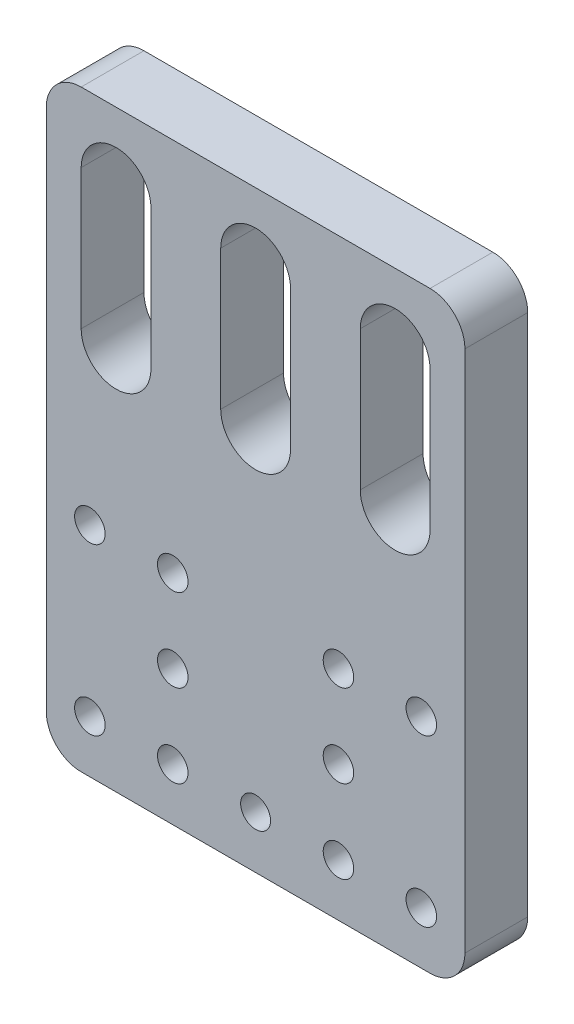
ISO-10303-21;
HEADER;
FILE_DESCRIPTION(('STEP AP214'),'2;1');
FILE_NAME('part.step','',(''),(''),'','','');
FILE_SCHEMA(('AUTOMOTIVE_DESIGN { 1 0 10303 214 1 1 1 1 }'));
ENDSEC;
DATA;
#1=APPLICATION_CONTEXT('core data for automotive mechanical design processes');
#2=APPLICATION_PROTOCOL_DEFINITION('international standard','automotive_design',2000,#1);
#3=PRODUCT_CONTEXT('',#1,'mechanical');
#4=PRODUCT('Part','Part','',(#3));
#5=PRODUCT_RELATED_PRODUCT_CATEGORY('part','',(#4));
#6=PRODUCT_DEFINITION_FORMATION('','',#4);
#7=PRODUCT_DEFINITION_CONTEXT('part definition',#1,'design');
#8=PRODUCT_DEFINITION('design','',#6,#7);
#9=PRODUCT_DEFINITION_SHAPE('','',#8);
#10=(LENGTH_UNIT() NAMED_UNIT(*) SI_UNIT(.MILLI.,.METRE.));
#11=(NAMED_UNIT(*) PLANE_ANGLE_UNIT() SI_UNIT($,.RADIAN.));
#12=(NAMED_UNIT(*) SI_UNIT($,.STERADIAN.) SOLID_ANGLE_UNIT());
#13=UNCERTAINTY_MEASURE_WITH_UNIT(LENGTH_MEASURE(1.E-05),#10,'distance_accuracy_value','');
#14=(GEOMETRIC_REPRESENTATION_CONTEXT(3) GLOBAL_UNCERTAINTY_ASSIGNED_CONTEXT((#13)) GLOBAL_UNIT_ASSIGNED_CONTEXT((#10,
#11,#12)) REPRESENTATION_CONTEXT('',''));
#15=CARTESIAN_POINT('',(0.,0.,0.));
#16=DIRECTION('',(0.,0.,1.));
#17=DIRECTION('',(1.,0.,0.));
#18=AXIS2_PLACEMENT_3D('',#15,#16,#17);
#19=CARTESIAN_POINT('',(0.,0.,3.6));
#20=DIRECTION('',(0.,0.,-1.));
#21=DIRECTION('',(-1.,0.,0.));
#22=AXIS2_PLACEMENT_3D('',#19,#20,#21);
#23=PLANE('',#22);
#24=CARTESIAN_POINT('',(4.75,-9.25000000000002,3.6));
#25=DIRECTION('',(0.,0.,-1.));
#26=DIRECTION('',(-1.,0.,0.));
#27=AXIS2_PLACEMENT_3D('',#24,#25,#26);
#28=CIRCLE('',#27,0.875);
#29=CARTESIAN_POINT('',(3.875,-9.25000000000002,3.6));
#30=VERTEX_POINT('',#29);
#31=EDGE_CURVE('E283',#30,#30,#28,.T.);
#32=ORIENTED_EDGE('',*,*,#31,.T.);
#33=EDGE_LOOP('',(#32));
#34=FACE_BOUND('',#33,.T.);
#35=CARTESIAN_POINT('',(-4.75,-9.25000000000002,3.6));
#36=DIRECTION('',(0.,0.,-1.));
#37=DIRECTION('',(-1.,0.,0.));
#38=AXIS2_PLACEMENT_3D('',#35,#36,#37);
#39=CIRCLE('',#38,0.875);
#40=CARTESIAN_POINT('',(-5.625,-9.25000000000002,3.6));
#41=VERTEX_POINT('',#40);
#42=EDGE_CURVE('E286',#41,#41,#39,.T.);
#43=ORIENTED_EDGE('',*,*,#42,.T.);
#44=EDGE_LOOP('',(#43));
#45=FACE_BOUND('',#44,.T.);
#46=CARTESIAN_POINT('',(0.,-14.,3.6));
#47=DIRECTION('',(0.,0.,1.));
#48=DIRECTION('',(1.,0.,0.));
#49=AXIS2_PLACEMENT_3D('',#46,#47,#48);
#50=CIRCLE('',#49,0.857839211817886);
#51=CARTESIAN_POINT('',(0.857839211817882,-14.,3.6));
#52=VERTEX_POINT('',#51);
#53=EDGE_CURVE('E289',#52,#52,#50,.F.);
#54=ORIENTED_EDGE('',*,*,#53,.T.);
#55=EDGE_LOOP('',(#54));
#56=FACE_BOUND('',#55,.T.);
#57=CARTESIAN_POINT('',(-4.75,-4.50000000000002,3.6));
#58=DIRECTION('',(0.,0.,-1.));
#59=DIRECTION('',(-1.,0.,0.));
#60=AXIS2_PLACEMENT_3D('',#57,#58,#59);
#61=CIRCLE('',#60,0.875);
#62=CARTESIAN_POINT('',(-5.625,-4.50000000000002,3.6));
#63=VERTEX_POINT('',#62);
#64=EDGE_CURVE('E292',#63,#63,#61,.T.);
#65=ORIENTED_EDGE('',*,*,#64,.T.);
#66=EDGE_LOOP('',(#65));
#67=FACE_BOUND('',#66,.T.);
#68=CARTESIAN_POINT('',(4.75,-4.50000000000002,3.6));
#69=DIRECTION('',(0.,0.,-1.));
#70=DIRECTION('',(-1.,0.,0.));
#71=AXIS2_PLACEMENT_3D('',#68,#69,#70);
#72=CIRCLE('',#71,0.875);
#73=CARTESIAN_POINT('',(3.875,-4.50000000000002,3.6));
#74=VERTEX_POINT('',#73);
#75=EDGE_CURVE('E295',#74,#74,#72,.T.);
#76=ORIENTED_EDGE('',*,*,#75,.T.);
#77=EDGE_LOOP('',(#76));
#78=FACE_BOUND('',#77,.T.);
#79=CARTESIAN_POINT('',(9.5,-14.,3.6));
#80=DIRECTION('',(0.,0.,-1.));
#81=DIRECTION('',(-1.,0.,0.));
#82=AXIS2_PLACEMENT_3D('',#79,#80,#81);
#83=CIRCLE('',#82,0.875000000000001);
#84=CARTESIAN_POINT('',(8.625,-14.,3.6));
#85=VERTEX_POINT('',#84);
#86=EDGE_CURVE('E201',#85,#85,#83,.T.);
#87=ORIENTED_EDGE('',*,*,#86,.T.);
#88=EDGE_LOOP('',(#87));
#89=FACE_BOUND('',#88,.T.);
#90=CARTESIAN_POINT('',(-9.5,-4.50000000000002,3.6));
#91=DIRECTION('',(0.,0.,-1.));
#92=DIRECTION('',(-1.,0.,0.));
#93=AXIS2_PLACEMENT_3D('',#90,#91,#92);
#94=CIRCLE('',#93,0.875000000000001);
#95=CARTESIAN_POINT('',(-10.375,-4.50000000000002,3.6));
#96=VERTEX_POINT('',#95);
#97=EDGE_CURVE('E312',#96,#96,#94,.T.);
#98=ORIENTED_EDGE('',*,*,#97,.T.);
#99=EDGE_LOOP('',(#98));
#100=FACE_BOUND('',#99,.T.);
#101=CARTESIAN_POINT('',(-9.5,-14.,3.6));
#102=DIRECTION('',(0.,0.,-1.));
#103=DIRECTION('',(-1.,0.,0.));
#104=AXIS2_PLACEMENT_3D('',#101,#102,#103);
#105=CIRCLE('',#104,0.875000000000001);
#106=CARTESIAN_POINT('',(-10.375,-14.,3.6));
#107=VERTEX_POINT('',#106);
#108=EDGE_CURVE('E315',#107,#107,#105,.T.);
#109=ORIENTED_EDGE('',*,*,#108,.T.);
#110=EDGE_LOOP('',(#109));
#111=FACE_BOUND('',#110,.T.);
#112=DIRECTION('',(0.,1.,0.));
#113=VECTOR('',#112,1.);
#114=CARTESIAN_POINT('',(-6.,13.,3.6));
#115=LINE('',#114,#113);
#116=CARTESIAN_POINT('',(-5.99999999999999,13.,3.6));
#117=VERTEX_POINT('',#116);
#118=CARTESIAN_POINT('',(-6.,4.99999999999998,3.6));
#119=VERTEX_POINT('',#118);
#120=EDGE_CURVE('E182',#117,#119,#115,.F.);
#121=ORIENTED_EDGE('',*,*,#120,.T.);
#122=CARTESIAN_POINT('',(-8.,4.99999999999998,3.6));
#123=DIRECTION('',(0.,0.,-1.));
#124=DIRECTION('',(-1.,0.,0.));
#125=AXIS2_PLACEMENT_3D('',#122,#123,#124);
#126=CIRCLE('',#125,2.);
#127=CARTESIAN_POINT('',(-10.,4.99999999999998,3.6));
#128=VERTEX_POINT('',#127);
#129=EDGE_CURVE('E299',#119,#128,#126,.T.);
#130=ORIENTED_EDGE('',*,*,#129,.T.);
#131=DIRECTION('',(0.,-1.,0.));
#132=VECTOR('',#131,1.);
#133=CARTESIAN_POINT('',(-10.,4.99999999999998,3.6));
#134=LINE('',#133,#132);
#135=CARTESIAN_POINT('',(-10.,13.,3.6));
#136=VERTEX_POINT('',#135);
#137=EDGE_CURVE('E186',#128,#136,#134,.F.);
#138=ORIENTED_EDGE('',*,*,#137,.T.);
#139=CARTESIAN_POINT('',(-7.99999999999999,13.,3.6));
#140=DIRECTION('',(0.,0.,-1.));
#141=DIRECTION('',(-1.,0.,0.));
#142=AXIS2_PLACEMENT_3D('',#139,#140,#141);
#143=CIRCLE('',#142,2.);
#144=EDGE_CURVE('E184',#136,#117,#143,.T.);
#145=ORIENTED_EDGE('',*,*,#144,.T.);
#146=EDGE_LOOP('',(#121,#130,#138,#145));
#147=FACE_BOUND('',#146,.T.);
#148=DIRECTION('',(0.,1.,0.));
#149=VECTOR('',#148,1.);
#150=CARTESIAN_POINT('',(2.,13.,3.6));
#151=LINE('',#150,#149);
#152=CARTESIAN_POINT('',(2.,13.,3.6));
#153=VERTEX_POINT('',#152);
#154=CARTESIAN_POINT('',(2.,4.99999999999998,3.6));
#155=VERTEX_POINT('',#154);
#156=EDGE_CURVE('E190',#153,#155,#151,.F.);
#157=ORIENTED_EDGE('',*,*,#156,.T.);
#158=CARTESIAN_POINT('',(0.,4.99999999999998,3.6));
#159=DIRECTION('',(0.,0.,-1.));
#160=DIRECTION('',(-1.,0.,0.));
#161=AXIS2_PLACEMENT_3D('',#158,#159,#160);
#162=CIRCLE('',#161,2.);
#163=CARTESIAN_POINT('',(-2.,4.99999999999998,3.6));
#164=VERTEX_POINT('',#163);
#165=EDGE_CURVE('E302',#155,#164,#162,.T.);
#166=ORIENTED_EDGE('',*,*,#165,.T.);
#167=DIRECTION('',(0.,-1.,0.));
#168=VECTOR('',#167,1.);
#169=CARTESIAN_POINT('',(-2.,4.99999999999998,3.6));
#170=LINE('',#169,#168);
#171=CARTESIAN_POINT('',(-2.,13.,3.6));
#172=VERTEX_POINT('',#171);
#173=EDGE_CURVE('E194',#164,#172,#170,.F.);
#174=ORIENTED_EDGE('',*,*,#173,.T.);
#175=CARTESIAN_POINT('',(0.,13.,3.6));
#176=DIRECTION('',(0.,0.,-1.));
#177=DIRECTION('',(-1.,0.,0.));
#178=AXIS2_PLACEMENT_3D('',#175,#176,#177);
#179=CIRCLE('',#178,2.);
#180=EDGE_CURVE('E192',#172,#153,#179,.T.);
#181=ORIENTED_EDGE('',*,*,#180,.T.);
#182=EDGE_LOOP('',(#157,#166,#174,#181));
#183=FACE_BOUND('',#182,.T.);
#184=CARTESIAN_POINT('',(10.,15.,3.6));
#185=DIRECTION('',(0.,0.,-1.));
#186=DIRECTION('',(-1.,0.,0.));
#187=AXIS2_PLACEMENT_3D('',#184,#185,#186);
#188=CIRCLE('',#187,2.);
#189=CARTESIAN_POINT('',(10.,17.,3.6));
#190=VERTEX_POINT('',#189);
#191=CARTESIAN_POINT('',(12.,15.,3.6));
#192=VERTEX_POINT('',#191);
#193=EDGE_CURVE('E151',#190,#192,#188,.T.);
#194=ORIENTED_EDGE('',*,*,#193,.F.);
#195=DIRECTION('',(1.,0.,0.));
#196=VECTOR('',#195,1.);
#197=CARTESIAN_POINT('',(12.,17.,3.6));
#198=LINE('',#197,#196);
#199=CARTESIAN_POINT('',(-10.,17.,3.6));
#200=VERTEX_POINT('',#199);
#201=EDGE_CURVE('E169',#190,#200,#198,.F.);
#202=ORIENTED_EDGE('',*,*,#201,.T.);
#203=CARTESIAN_POINT('',(-10.,15.,3.6));
#204=DIRECTION('',(0.,0.,-1.));
#205=DIRECTION('',(-1.,0.,0.));
#206=AXIS2_PLACEMENT_3D('',#203,#204,#205);
#207=CIRCLE('',#206,2.);
#208=CARTESIAN_POINT('',(-12.,15.,3.6));
#209=VERTEX_POINT('',#208);
#210=EDGE_CURVE('E209',#209,#200,#207,.T.);
#211=ORIENTED_EDGE('',*,*,#210,.F.);
#212=DIRECTION('',(0.,1.,0.));
#213=VECTOR('',#212,1.);
#214=CARTESIAN_POINT('',(-12.,17.,3.6));
#215=LINE('',#214,#213);
#216=CARTESIAN_POINT('',(-12.,-15.,3.6));
#217=VERTEX_POINT('',#216);
#218=EDGE_CURVE('E206',#209,#217,#215,.F.);
#219=ORIENTED_EDGE('',*,*,#218,.T.);
#220=CARTESIAN_POINT('',(-9.99999999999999,-15.,3.6));
#221=DIRECTION('',(0.,0.,-1.));
#222=DIRECTION('',(-1.,0.,0.));
#223=AXIS2_PLACEMENT_3D('',#220,#221,#222);
#224=CIRCLE('',#223,2.);
#225=CARTESIAN_POINT('',(-9.99999999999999,-17.,3.6));
#226=VERTEX_POINT('',#225);
#227=EDGE_CURVE('E322',#226,#217,#224,.T.);
#228=ORIENTED_EDGE('',*,*,#227,.F.);
#229=DIRECTION('',(-1.,0.,0.));
#230=VECTOR('',#229,1.);
#231=CARTESIAN_POINT('',(12.,-17.,3.6));
#232=LINE('',#231,#230);
#233=CARTESIAN_POINT('',(10.,-17.,3.6));
#234=VERTEX_POINT('',#233);
#235=EDGE_CURVE('E213',#226,#234,#232,.F.);
#236=ORIENTED_EDGE('',*,*,#235,.T.);
#237=CARTESIAN_POINT('',(10.,-15.,3.6));
#238=DIRECTION('',(0.,0.,-1.));
#239=DIRECTION('',(-1.,0.,0.));
#240=AXIS2_PLACEMENT_3D('',#237,#238,#239);
#241=CIRCLE('',#240,2.);
#242=CARTESIAN_POINT('',(12.,-15.,3.6));
#243=VERTEX_POINT('',#242);
#244=EDGE_CURVE('E157',#243,#234,#241,.T.);
#245=ORIENTED_EDGE('',*,*,#244,.F.);
#246=DIRECTION('',(0.,-1.,0.));
#247=VECTOR('',#246,1.);
#248=CARTESIAN_POINT('',(12.,17.,3.6));
#249=LINE('',#248,#247);
#250=EDGE_CURVE('E154',#243,#192,#249,.F.);
#251=ORIENTED_EDGE('',*,*,#250,.T.);
#252=EDGE_LOOP('',(#194,#202,#211,#219,#228,#236,#245,#251));
#253=FACE_BOUND('',#252,.T.);
#254=DIRECTION('',(0.,1.,0.));
#255=VECTOR('',#254,1.);
#256=CARTESIAN_POINT('',(10.,13.,3.6));
#257=LINE('',#256,#255);
#258=CARTESIAN_POINT('',(10.,13.,3.6));
#259=VERTEX_POINT('',#258);
#260=CARTESIAN_POINT('',(10.,4.99999999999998,3.6));
#261=VERTEX_POINT('',#260);
#262=EDGE_CURVE('E198',#259,#261,#257,.F.);
#263=ORIENTED_EDGE('',*,*,#262,.T.);
#264=CARTESIAN_POINT('',(8.,4.99999999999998,3.6));
#265=DIRECTION('',(0.,0.,-1.));
#266=DIRECTION('',(-1.,0.,0.));
#267=AXIS2_PLACEMENT_3D('',#264,#265,#266);
#268=CIRCLE('',#267,2.);
#269=CARTESIAN_POINT('',(6.,4.99999999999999,3.6));
#270=VERTEX_POINT('',#269);
#271=EDGE_CURVE('E306',#261,#270,#268,.T.);
#272=ORIENTED_EDGE('',*,*,#271,.T.);
#273=DIRECTION('',(0.,-1.,0.));
#274=VECTOR('',#273,1.);
#275=CARTESIAN_POINT('',(6.,4.99999999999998,3.6));
#276=LINE('',#275,#274);
#277=CARTESIAN_POINT('',(6.,13.,3.6));
#278=VERTEX_POINT('',#277);
#279=EDGE_CURVE('E202',#270,#278,#276,.F.);
#280=ORIENTED_EDGE('',*,*,#279,.T.);
#281=CARTESIAN_POINT('',(8.,13.,3.6));
#282=DIRECTION('',(0.,0.,-1.));
#283=DIRECTION('',(-1.,0.,0.));
#284=AXIS2_PLACEMENT_3D('',#281,#282,#283);
#285=CIRCLE('',#284,2.);
#286=EDGE_CURVE('E200',#278,#259,#285,.T.);
#287=ORIENTED_EDGE('',*,*,#286,.T.);
#288=EDGE_LOOP('',(#263,#272,#280,#287));
#289=FACE_BOUND('',#288,.T.);
#290=CARTESIAN_POINT('',(-4.75,-14.,3.6));
#291=DIRECTION('',(0.,0.,-1.));
#292=DIRECTION('',(-1.,0.,0.));
#293=AXIS2_PLACEMENT_3D('',#290,#291,#292);
#294=CIRCLE('',#293,0.875);
#295=CARTESIAN_POINT('',(-5.625,-14.,3.6));
#296=VERTEX_POINT('',#295);
#297=EDGE_CURVE('E212',#296,#296,#294,.T.);
#298=ORIENTED_EDGE('',*,*,#297,.T.);
#299=EDGE_LOOP('',(#298));
#300=FACE_BOUND('',#299,.T.);
#301=CARTESIAN_POINT('',(4.75,-14.,3.6));
#302=DIRECTION('',(0.,0.,-1.));
#303=DIRECTION('',(-1.,0.,0.));
#304=AXIS2_PLACEMENT_3D('',#301,#302,#303);
#305=CIRCLE('',#304,0.875);
#306=CARTESIAN_POINT('',(3.875,-14.,3.6));
#307=VERTEX_POINT('',#306);
#308=EDGE_CURVE('E326',#307,#307,#305,.T.);
#309=ORIENTED_EDGE('',*,*,#308,.T.);
#310=EDGE_LOOP('',(#309));
#311=FACE_BOUND('',#310,.T.);
#312=CARTESIAN_POINT('',(9.5,-4.50000000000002,3.6));
#313=DIRECTION('',(0.,0.,-1.));
#314=DIRECTION('',(-1.,0.,0.));
#315=AXIS2_PLACEMENT_3D('',#312,#313,#314);
#316=CIRCLE('',#315,0.875000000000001);
#317=CARTESIAN_POINT('',(8.625,-4.50000000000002,3.6));
#318=VERTEX_POINT('',#317);
#319=EDGE_CURVE('E19',#318,#318,#316,.T.);
#320=ORIENTED_EDGE('',*,*,#319,.T.);
#321=EDGE_LOOP('',(#320));
#322=FACE_BOUND('',#321,.T.);
#323=ADVANCED_FACE('F16',(#34,#45,#56,#67,#78,#89,#100,#111,#147,#183,#253,#289,#300,#311,#322),
#23,.F.);
#324=CARTESIAN_POINT('',(9.5,-4.50000000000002,3.6));
#325=DIRECTION('',(0.,0.,-1.));
#326=DIRECTION('',(-1.,0.,0.));
#327=AXIS2_PLACEMENT_3D('',#324,#325,#326);
#328=CYLINDRICAL_SURFACE('',#327,0.875000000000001);
#329=ORIENTED_EDGE('',*,*,#319,.F.);
#330=EDGE_LOOP('',(#329));
#331=FACE_BOUND('',#330,.T.);
#332=CARTESIAN_POINT('',(9.5,-4.50000000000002,0.));
#333=DIRECTION('',(0.,0.,-1.));
#334=DIRECTION('',(-1.,0.,0.));
#335=AXIS2_PLACEMENT_3D('',#332,#333,#334);
#336=CIRCLE('',#335,0.875000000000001);
#337=CARTESIAN_POINT('',(8.625,-4.50000000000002,0.));
#338=VERTEX_POINT('',#337);
#339=EDGE_CURVE('E280',#338,#338,#336,.F.);
#340=ORIENTED_EDGE('',*,*,#339,.F.);
#341=EDGE_LOOP('',(#340));
#342=FACE_BOUND('',#341,.T.);
#343=ADVANCED_FACE('F334',(#331,#342),#328,.F.);
#344=CARTESIAN_POINT('',(4.75,-14.,3.6));
#345=DIRECTION('',(0.,0.,-1.));
#346=DIRECTION('',(-1.,0.,0.));
#347=AXIS2_PLACEMENT_3D('',#344,#345,#346);
#348=CYLINDRICAL_SURFACE('',#347,0.875);
#349=ORIENTED_EDGE('',*,*,#308,.F.);
#350=EDGE_LOOP('',(#349));
#351=FACE_BOUND('',#350,.T.);
#352=CARTESIAN_POINT('',(4.75,-14.,0.));
#353=DIRECTION('',(0.,0.,-1.));
#354=DIRECTION('',(-1.,0.,0.));
#355=AXIS2_PLACEMENT_3D('',#352,#353,#354);
#356=CIRCLE('',#355,0.875);
#357=CARTESIAN_POINT('',(3.875,-14.,0.));
#358=VERTEX_POINT('',#357);
#359=EDGE_CURVE('E277',#358,#358,#356,.F.);
#360=ORIENTED_EDGE('',*,*,#359,.F.);
#361=EDGE_LOOP('',(#360));
#362=FACE_BOUND('',#361,.T.);
#363=ADVANCED_FACE('F337',(#351,#362),#348,.F.);
#364=CARTESIAN_POINT('',(-4.75,-14.,3.6));
#365=DIRECTION('',(0.,0.,-1.));
#366=DIRECTION('',(-1.,0.,0.));
#367=AXIS2_PLACEMENT_3D('',#364,#365,#366);
#368=CYLINDRICAL_SURFACE('',#367,0.875);
#369=CARTESIAN_POINT('',(-4.75,-14.,0.));
#370=DIRECTION('',(0.,0.,-1.));
#371=DIRECTION('',(-1.,0.,0.));
#372=AXIS2_PLACEMENT_3D('',#369,#370,#371);
#373=CIRCLE('',#372,0.875);
#374=CARTESIAN_POINT('',(-5.625,-14.,0.));
#375=VERTEX_POINT('',#374);
#376=EDGE_CURVE('E274',#375,#375,#373,.F.);
#377=ORIENTED_EDGE('',*,*,#376,.F.);
#378=EDGE_LOOP('',(#377));
#379=FACE_BOUND('',#378,.T.);
#380=ORIENTED_EDGE('',*,*,#297,.F.);
#381=EDGE_LOOP('',(#380));
#382=FACE_BOUND('',#381,.T.);
#383=ADVANCED_FACE('F455',(#379,#382),#368,.F.);
#384=CARTESIAN_POINT('',(12.,17.,3.6));
#385=DIRECTION('',(0.,-1.,0.));
#386=DIRECTION('',(1.,0.,0.));
#387=AXIS2_PLACEMENT_3D('',#384,#385,#386);
#388=PLANE('',#387);
#389=DIRECTION('',(0.,0.,-1.));
#390=VECTOR('',#389,1.);
#391=CARTESIAN_POINT('',(10.,17.,3.6));
#392=LINE('',#391,#390);
#393=CARTESIAN_POINT('',(10.,17.,0.));
#394=VERTEX_POINT('',#393);
#395=EDGE_CURVE('E162',#394,#190,#392,.F.);
#396=ORIENTED_EDGE('',*,*,#395,.F.);
#397=DIRECTION('',(-1.,0.,0.));
#398=VECTOR('',#397,1.);
#399=CARTESIAN_POINT('',(0.,17.,0.));
#400=LINE('',#399,#398);
#401=CARTESIAN_POINT('',(-10.,17.,0.));
#402=VERTEX_POINT('',#401);
#403=EDGE_CURVE('E273',#402,#394,#400,.F.);
#404=ORIENTED_EDGE('',*,*,#403,.F.);
#405=DIRECTION('',(0.,0.,-1.));
#406=VECTOR('',#405,1.);
#407=CARTESIAN_POINT('',(-10.,17.,3.6));
#408=LINE('',#407,#406);
#409=EDGE_CURVE('E321',#200,#402,#408,.T.);
#410=ORIENTED_EDGE('',*,*,#409,.F.);
#411=ORIENTED_EDGE('',*,*,#201,.F.);
#412=EDGE_LOOP('',(#396,#404,#410,#411));
#413=FACE_BOUND('',#412,.T.);
#414=ADVANCED_FACE('F452',(#413),#388,.F.);
#415=CARTESIAN_POINT('',(10.,15.,3.6));
#416=DIRECTION('',(0.,0.,-1.));
#417=DIRECTION('',(-1.,0.,0.));
#418=AXIS2_PLACEMENT_3D('',#415,#416,#417);
#419=CYLINDRICAL_SURFACE('',#418,2.);
#420=CARTESIAN_POINT('',(10.,15.,0.));
#421=DIRECTION('',(0.,0.,-1.));
#422=DIRECTION('',(-1.,0.,0.));
#423=AXIS2_PLACEMENT_3D('',#420,#421,#422);
#424=CIRCLE('',#423,2.);
#425=CARTESIAN_POINT('',(12.,15.,0.));
#426=VERTEX_POINT('',#425);
#427=EDGE_CURVE('E271',#394,#426,#424,.T.);
#428=ORIENTED_EDGE('',*,*,#427,.F.);
#429=ORIENTED_EDGE('',*,*,#395,.T.);
#430=ORIENTED_EDGE('',*,*,#193,.T.);
#431=DIRECTION('',(0.,0.,1.));
#432=VECTOR('',#431,1.);
#433=CARTESIAN_POINT('',(12.,15.,3.6));
#434=LINE('',#433,#432);
#435=EDGE_CURVE('E161',#192,#426,#434,.F.);
#436=ORIENTED_EDGE('',*,*,#435,.T.);
#437=EDGE_LOOP('',(#428,#429,#430,#436));
#438=FACE_BOUND('',#437,.T.);
#439=ADVANCED_FACE('F167',(#438),#419,.T.);
#440=CARTESIAN_POINT('',(12.,17.,3.6));
#441=DIRECTION('',(-1.,0.,0.));
#442=DIRECTION('',(0.,-1.,0.));
#443=AXIS2_PLACEMENT_3D('',#440,#441,#442);
#444=PLANE('',#443);
#445=ORIENTED_EDGE('',*,*,#435,.F.);
#446=ORIENTED_EDGE('',*,*,#250,.F.);
#447=DIRECTION('',(0.,0.,-1.));
#448=VECTOR('',#447,1.);
#449=CARTESIAN_POINT('',(12.,-15.,3.6));
#450=LINE('',#449,#448);
#451=CARTESIAN_POINT('',(12.,-15.,0.));
#452=VERTEX_POINT('',#451);
#453=EDGE_CURVE('E176',#452,#243,#450,.F.);
#454=ORIENTED_EDGE('',*,*,#453,.F.);
#455=DIRECTION('',(0.,1.,0.));
#456=VECTOR('',#455,1.);
#457=CARTESIAN_POINT('',(12.,0.,0.));
#458=LINE('',#457,#456);
#459=EDGE_CURVE('E173',#426,#452,#458,.F.);
#460=ORIENTED_EDGE('',*,*,#459,.F.);
#461=EDGE_LOOP('',(#445,#446,#454,#460));
#462=FACE_BOUND('',#461,.T.);
#463=ADVANCED_FACE('F171',(#462),#444,.F.);
#464=CARTESIAN_POINT('',(10.,-15.,3.6));
#465=DIRECTION('',(0.,0.,-1.));
#466=DIRECTION('',(-1.,0.,0.));
#467=AXIS2_PLACEMENT_3D('',#464,#465,#466);
#468=CYLINDRICAL_SURFACE('',#467,2.);
#469=CARTESIAN_POINT('',(10.,-15.,0.));
#470=DIRECTION('',(0.,0.,-1.));
#471=DIRECTION('',(-1.,0.,0.));
#472=AXIS2_PLACEMENT_3D('',#469,#470,#471);
#473=CIRCLE('',#472,2.);
#474=CARTESIAN_POINT('',(10.,-17.,0.));
#475=VERTEX_POINT('',#474);
#476=EDGE_CURVE('E268',#452,#475,#473,.T.);
#477=ORIENTED_EDGE('',*,*,#476,.F.);
#478=ORIENTED_EDGE('',*,*,#453,.T.);
#479=ORIENTED_EDGE('',*,*,#244,.T.);
#480=DIRECTION('',(0.,0.,1.));
#481=VECTOR('',#480,1.);
#482=CARTESIAN_POINT('',(10.,-17.,3.6));
#483=LINE('',#482,#481);
#484=EDGE_CURVE('E214',#234,#475,#483,.F.);
#485=ORIENTED_EDGE('',*,*,#484,.T.);
#486=EDGE_LOOP('',(#477,#478,#479,#485));
#487=FACE_BOUND('',#486,.T.);
#488=ADVANCED_FACE('F443',(#487),#468,.T.);
#489=CARTESIAN_POINT('',(12.,-17.,3.6));
#490=DIRECTION('',(0.,1.,0.));
#491=DIRECTION('',(-1.,0.,0.));
#492=AXIS2_PLACEMENT_3D('',#489,#490,#491);
#493=PLANE('',#492);
#494=ORIENTED_EDGE('',*,*,#484,.F.);
#495=ORIENTED_EDGE('',*,*,#235,.F.);
#496=DIRECTION('',(0.,0.,-1.));
#497=VECTOR('',#496,1.);
#498=CARTESIAN_POINT('',(-9.99999999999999,-17.,3.6));
#499=LINE('',#498,#497);
#500=CARTESIAN_POINT('',(-9.99999999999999,-17.,0.));
#501=VERTEX_POINT('',#500);
#502=EDGE_CURVE('E323',#501,#226,#499,.F.);
#503=ORIENTED_EDGE('',*,*,#502,.F.);
#504=DIRECTION('',(-1.,0.,0.));
#505=VECTOR('',#504,1.);
#506=CARTESIAN_POINT('',(0.,-17.,0.));
#507=LINE('',#506,#505);
#508=EDGE_CURVE('E267',#475,#501,#507,.T.);
#509=ORIENTED_EDGE('',*,*,#508,.F.);
#510=EDGE_LOOP('',(#494,#495,#503,#509));
#511=FACE_BOUND('',#510,.T.);
#512=ADVANCED_FACE('F439',(#511),#493,.F.);
#513=CARTESIAN_POINT('',(-9.99999999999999,-15.,3.6));
#514=DIRECTION('',(0.,0.,-1.));
#515=DIRECTION('',(-1.,0.,0.));
#516=AXIS2_PLACEMENT_3D('',#513,#514,#515);
#517=CYLINDRICAL_SURFACE('',#516,2.);
#518=CARTESIAN_POINT('',(-9.99999999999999,-15.,0.));
#519=DIRECTION('',(0.,0.,-1.));
#520=DIRECTION('',(-1.,0.,0.));
#521=AXIS2_PLACEMENT_3D('',#518,#519,#520);
#522=CIRCLE('',#521,2.);
#523=CARTESIAN_POINT('',(-12.,-15.,0.));
#524=VERTEX_POINT('',#523);
#525=EDGE_CURVE('E264',#501,#524,#522,.T.);
#526=ORIENTED_EDGE('',*,*,#525,.F.);
#527=ORIENTED_EDGE('',*,*,#502,.T.);
#528=ORIENTED_EDGE('',*,*,#227,.T.);
#529=DIRECTION('',(0.,0.,1.));
#530=VECTOR('',#529,1.);
#531=CARTESIAN_POINT('',(-12.,-15.,3.6));
#532=LINE('',#531,#530);
#533=EDGE_CURVE('E210',#217,#524,#532,.F.);
#534=ORIENTED_EDGE('',*,*,#533,.T.);
#535=EDGE_LOOP('',(#526,#527,#528,#534));
#536=FACE_BOUND('',#535,.T.);
#537=ADVANCED_FACE('F435',(#536),#517,.T.);
#538=CARTESIAN_POINT('',(-12.,17.,3.6));
#539=DIRECTION('',(1.,0.,0.));
#540=DIRECTION('',(0.,1.,0.));
#541=AXIS2_PLACEMENT_3D('',#538,#539,#540);
#542=PLANE('',#541);
#543=DIRECTION('',(0.,0.,-1.));
#544=VECTOR('',#543,1.);
#545=CARTESIAN_POINT('',(-12.,15.,3.6));
#546=LINE('',#545,#544);
#547=CARTESIAN_POINT('',(-12.,15.,0.));
#548=VERTEX_POINT('',#547);
#549=EDGE_CURVE('E318',#548,#209,#546,.F.);
#550=ORIENTED_EDGE('',*,*,#549,.F.);
#551=DIRECTION('',(0.,1.,0.));
#552=VECTOR('',#551,1.);
#553=CARTESIAN_POINT('',(-12.,0.,0.));
#554=LINE('',#553,#552);
#555=EDGE_CURVE('E263',#524,#548,#554,.T.);
#556=ORIENTED_EDGE('',*,*,#555,.F.);
#557=ORIENTED_EDGE('',*,*,#533,.F.);
#558=ORIENTED_EDGE('',*,*,#218,.F.);
#559=EDGE_LOOP('',(#550,#556,#557,#558));
#560=FACE_BOUND('',#559,.T.);
#561=ADVANCED_FACE('F431',(#560),#542,.F.);
#562=CARTESIAN_POINT('',(-10.,15.,3.6));
#563=DIRECTION('',(0.,0.,-1.));
#564=DIRECTION('',(-1.,0.,0.));
#565=AXIS2_PLACEMENT_3D('',#562,#563,#564);
#566=CYLINDRICAL_SURFACE('',#565,2.);
#567=CARTESIAN_POINT('',(-10.,15.,0.));
#568=DIRECTION('',(0.,0.,-1.));
#569=DIRECTION('',(-1.,0.,0.));
#570=AXIS2_PLACEMENT_3D('',#567,#568,#569);
#571=CIRCLE('',#570,2.);
#572=EDGE_CURVE('E260',#548,#402,#571,.T.);
#573=ORIENTED_EDGE('',*,*,#572,.F.);
#574=ORIENTED_EDGE('',*,*,#549,.T.);
#575=ORIENTED_EDGE('',*,*,#210,.T.);
#576=ORIENTED_EDGE('',*,*,#409,.T.);
#577=EDGE_LOOP('',(#573,#574,#575,#576));
#578=FACE_BOUND('',#577,.T.);
#579=ADVANCED_FACE('F427',(#578),#566,.T.);
#580=CARTESIAN_POINT('',(-9.5,-14.,3.6));
#581=DIRECTION('',(0.,0.,-1.));
#582=DIRECTION('',(-1.,0.,0.));
#583=AXIS2_PLACEMENT_3D('',#580,#581,#582);
#584=CYLINDRICAL_SURFACE('',#583,0.875000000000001);
#585=CARTESIAN_POINT('',(-9.5,-14.,0.));
#586=DIRECTION('',(0.,0.,-1.));
#587=DIRECTION('',(-1.,0.,0.));
#588=AXIS2_PLACEMENT_3D('',#585,#586,#587);
#589=CIRCLE('',#588,0.875000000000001);
#590=CARTESIAN_POINT('',(-10.375,-14.,0.));
#591=VERTEX_POINT('',#590);
#592=EDGE_CURVE('E257',#591,#591,#589,.F.);
#593=ORIENTED_EDGE('',*,*,#592,.F.);
#594=EDGE_LOOP('',(#593));
#595=FACE_BOUND('',#594,.T.);
#596=ORIENTED_EDGE('',*,*,#108,.F.);
#597=EDGE_LOOP('',(#596));
#598=FACE_BOUND('',#597,.T.);
#599=ADVANCED_FACE('F423',(#595,#598),#584,.F.);
#600=CARTESIAN_POINT('',(-9.5,-4.50000000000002,3.6));
#601=DIRECTION('',(0.,0.,-1.));
#602=DIRECTION('',(-1.,0.,0.));
#603=AXIS2_PLACEMENT_3D('',#600,#601,#602);
#604=CYLINDRICAL_SURFACE('',#603,0.875000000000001);
#605=CARTESIAN_POINT('',(-9.5,-4.50000000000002,0.));
#606=DIRECTION('',(0.,0.,-1.));
#607=DIRECTION('',(-1.,0.,0.));
#608=AXIS2_PLACEMENT_3D('',#605,#606,#607);
#609=CIRCLE('',#608,0.875000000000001);
#610=CARTESIAN_POINT('',(-10.375,-4.50000000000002,0.));
#611=VERTEX_POINT('',#610);
#612=EDGE_CURVE('E254',#611,#611,#609,.F.);
#613=ORIENTED_EDGE('',*,*,#612,.F.);
#614=EDGE_LOOP('',(#613));
#615=FACE_BOUND('',#614,.T.);
#616=ORIENTED_EDGE('',*,*,#97,.F.);
#617=EDGE_LOOP('',(#616));
#618=FACE_BOUND('',#617,.T.);
#619=ADVANCED_FACE('F419',(#615,#618),#604,.F.);
#620=CARTESIAN_POINT('',(9.5,-14.,3.6));
#621=DIRECTION('',(0.,0.,-1.));
#622=DIRECTION('',(-1.,0.,0.));
#623=AXIS2_PLACEMENT_3D('',#620,#621,#622);
#624=CYLINDRICAL_SURFACE('',#623,0.875000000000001);
#625=ORIENTED_EDGE('',*,*,#86,.F.);
#626=EDGE_LOOP('',(#625));
#627=FACE_BOUND('',#626,.T.);
#628=CARTESIAN_POINT('',(9.5,-14.,0.));
#629=DIRECTION('',(0.,0.,-1.));
#630=DIRECTION('',(-1.,0.,0.));
#631=AXIS2_PLACEMENT_3D('',#628,#629,#630);
#632=CIRCLE('',#631,0.875000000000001);
#633=CARTESIAN_POINT('',(8.625,-14.,0.));
#634=VERTEX_POINT('',#633);
#635=EDGE_CURVE('E251',#634,#634,#632,.F.);
#636=ORIENTED_EDGE('',*,*,#635,.F.);
#637=EDGE_LOOP('',(#636));
#638=FACE_BOUND('',#637,.T.);
#639=ADVANCED_FACE('F415',(#627,#638),#624,.F.);
#640=CARTESIAN_POINT('',(10.,13.,3.6));
#641=DIRECTION('',(1.,0.,0.));
#642=DIRECTION('',(0.,1.,0.));
#643=AXIS2_PLACEMENT_3D('',#640,#641,#642);
#644=PLANE('',#643);
#645=DIRECTION('',(0.,0.,-1.));
#646=VECTOR('',#645,1.);
#647=CARTESIAN_POINT('',(10.,4.99999999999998,3.6));
#648=LINE('',#647,#646);
#649=CARTESIAN_POINT('',(10.,4.99999999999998,0.));
#650=VERTEX_POINT('',#649);
#651=EDGE_CURVE('E193',#650,#261,#648,.F.);
#652=ORIENTED_EDGE('',*,*,#651,.T.);
#653=ORIENTED_EDGE('',*,*,#262,.F.);
#654=DIRECTION('',(0.,0.,-1.));
#655=VECTOR('',#654,1.);
#656=CARTESIAN_POINT('',(10.,13.,3.6));
#657=LINE('',#656,#655);
#658=CARTESIAN_POINT('',(10.,13.,0.));
#659=VERTEX_POINT('',#658);
#660=EDGE_CURVE('E205',#259,#659,#657,.T.);
#661=ORIENTED_EDGE('',*,*,#660,.T.);
#662=DIRECTION('',(0.,1.,0.));
#663=VECTOR('',#662,1.);
#664=CARTESIAN_POINT('',(10.,0.,0.));
#665=LINE('',#664,#663);
#666=EDGE_CURVE('E250',#650,#659,#665,.T.);
#667=ORIENTED_EDGE('',*,*,#666,.F.);
#668=EDGE_LOOP('',(#652,#653,#661,#667));
#669=FACE_BOUND('',#668,.T.);
#670=ADVANCED_FACE('F411',(#669),#644,.F.);
#671=CARTESIAN_POINT('',(8.,13.,3.6));
#672=DIRECTION('',(0.,0.,-1.));
#673=DIRECTION('',(-1.,0.,0.));
#674=AXIS2_PLACEMENT_3D('',#671,#672,#673);
#675=CYLINDRICAL_SURFACE('',#674,2.);
#676=ORIENTED_EDGE('',*,*,#660,.F.);
#677=ORIENTED_EDGE('',*,*,#286,.F.);
#678=DIRECTION('',(0.,0.,1.));
#679=VECTOR('',#678,1.);
#680=CARTESIAN_POINT('',(6.,13.,3.6));
#681=LINE('',#680,#679);
#682=CARTESIAN_POINT('',(6.,13.,0.));
#683=VERTEX_POINT('',#682);
#684=EDGE_CURVE('E204',#278,#683,#681,.F.);
#685=ORIENTED_EDGE('',*,*,#684,.T.);
#686=CARTESIAN_POINT('',(8.,13.,0.));
#687=DIRECTION('',(0.,0.,-1.));
#688=DIRECTION('',(-1.,0.,0.));
#689=AXIS2_PLACEMENT_3D('',#686,#687,#688);
#690=CIRCLE('',#689,2.);
#691=EDGE_CURVE('E247',#659,#683,#690,.F.);
#692=ORIENTED_EDGE('',*,*,#691,.F.);
#693=EDGE_LOOP('',(#676,#677,#685,#692));
#694=FACE_BOUND('',#693,.T.);
#695=ADVANCED_FACE('F407',(#694),#675,.F.);
#696=CARTESIAN_POINT('',(6.,4.99999999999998,3.6));
#697=DIRECTION('',(-1.,0.,0.));
#698=DIRECTION('',(0.,-1.,0.));
#699=AXIS2_PLACEMENT_3D('',#696,#697,#698);
#700=PLANE('',#699);
#701=ORIENTED_EDGE('',*,*,#684,.F.);
#702=ORIENTED_EDGE('',*,*,#279,.F.);
#703=DIRECTION('',(0.,0.,-1.));
#704=VECTOR('',#703,1.);
#705=CARTESIAN_POINT('',(6.,4.99999999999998,3.6));
#706=LINE('',#705,#704);
#707=CARTESIAN_POINT('',(6.,4.99999999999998,0.));
#708=VERTEX_POINT('',#707);
#709=EDGE_CURVE('E308',#270,#708,#706,.T.);
#710=ORIENTED_EDGE('',*,*,#709,.T.);
#711=DIRECTION('',(0.,1.,0.));
#712=VECTOR('',#711,1.);
#713=CARTESIAN_POINT('',(6.,0.,0.));
#714=LINE('',#713,#712);
#715=EDGE_CURVE('E246',#683,#708,#714,.F.);
#716=ORIENTED_EDGE('',*,*,#715,.F.);
#717=EDGE_LOOP('',(#701,#702,#710,#716));
#718=FACE_BOUND('',#717,.T.);
#719=ADVANCED_FACE('F403',(#718),#700,.F.);
#720=CARTESIAN_POINT('',(8.,4.99999999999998,3.6));
#721=DIRECTION('',(0.,0.,-1.));
#722=DIRECTION('',(-1.,0.,0.));
#723=AXIS2_PLACEMENT_3D('',#720,#721,#722);
#724=CYLINDRICAL_SURFACE('',#723,2.);
#725=CARTESIAN_POINT('',(8.,4.99999999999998,0.));
#726=DIRECTION('',(0.,0.,-1.));
#727=DIRECTION('',(-1.,0.,0.));
#728=AXIS2_PLACEMENT_3D('',#725,#726,#727);
#729=CIRCLE('',#728,2.);
#730=EDGE_CURVE('E243',#708,#650,#729,.F.);
#731=ORIENTED_EDGE('',*,*,#730,.F.);
#732=ORIENTED_EDGE('',*,*,#709,.F.);
#733=ORIENTED_EDGE('',*,*,#271,.F.);
#734=ORIENTED_EDGE('',*,*,#651,.F.);
#735=EDGE_LOOP('',(#731,#732,#733,#734));
#736=FACE_BOUND('',#735,.T.);
#737=ADVANCED_FACE('F399',(#736),#724,.F.);
#738=CARTESIAN_POINT('',(2.,13.,3.6));
#739=DIRECTION('',(1.,0.,0.));
#740=DIRECTION('',(0.,1.,0.));
#741=AXIS2_PLACEMENT_3D('',#738,#739,#740);
#742=PLANE('',#741);
#743=DIRECTION('',(0.,0.,-1.));
#744=VECTOR('',#743,1.);
#745=CARTESIAN_POINT('',(2.,4.99999999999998,3.6));
#746=LINE('',#745,#744);
#747=CARTESIAN_POINT('',(2.,4.99999999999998,0.));
#748=VERTEX_POINT('',#747);
#749=EDGE_CURVE('E185',#748,#155,#746,.F.);
#750=ORIENTED_EDGE('',*,*,#749,.T.);
#751=ORIENTED_EDGE('',*,*,#156,.F.);
#752=DIRECTION('',(0.,0.,-1.));
#753=VECTOR('',#752,1.);
#754=CARTESIAN_POINT('',(2.,13.,3.6));
#755=LINE('',#754,#753);
#756=CARTESIAN_POINT('',(2.,13.,0.));
#757=VERTEX_POINT('',#756);
#758=EDGE_CURVE('E197',#153,#757,#755,.T.);
#759=ORIENTED_EDGE('',*,*,#758,.T.);
#760=DIRECTION('',(0.,1.,0.));
#761=VECTOR('',#760,1.);
#762=CARTESIAN_POINT('',(2.,0.,0.));
#763=LINE('',#762,#761);
#764=EDGE_CURVE('E242',#748,#757,#763,.T.);
#765=ORIENTED_EDGE('',*,*,#764,.F.);
#766=EDGE_LOOP('',(#750,#751,#759,#765));
#767=FACE_BOUND('',#766,.T.);
#768=ADVANCED_FACE('F395',(#767),#742,.F.);
#769=CARTESIAN_POINT('',(0.,13.,3.6));
#770=DIRECTION('',(0.,0.,-1.));
#771=DIRECTION('',(-1.,0.,0.));
#772=AXIS2_PLACEMENT_3D('',#769,#770,#771);
#773=CYLINDRICAL_SURFACE('',#772,2.);
#774=ORIENTED_EDGE('',*,*,#758,.F.);
#775=ORIENTED_EDGE('',*,*,#180,.F.);
#776=DIRECTION('',(0.,0.,1.));
#777=VECTOR('',#776,1.);
#778=CARTESIAN_POINT('',(-2.,13.,3.6));
#779=LINE('',#778,#777);
#780=CARTESIAN_POINT('',(-2.,13.,0.));
#781=VERTEX_POINT('',#780);
#782=EDGE_CURVE('E196',#172,#781,#779,.F.);
#783=ORIENTED_EDGE('',*,*,#782,.T.);
#784=CARTESIAN_POINT('',(0.,13.,0.));
#785=DIRECTION('',(0.,0.,-1.));
#786=DIRECTION('',(-1.,0.,0.));
#787=AXIS2_PLACEMENT_3D('',#784,#785,#786);
#788=CIRCLE('',#787,2.);
#789=EDGE_CURVE('E239',#757,#781,#788,.F.);
#790=ORIENTED_EDGE('',*,*,#789,.F.);
#791=EDGE_LOOP('',(#774,#775,#783,#790));
#792=FACE_BOUND('',#791,.T.);
#793=ADVANCED_FACE('F391',(#792),#773,.F.);
#794=CARTESIAN_POINT('',(-2.,4.99999999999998,3.6));
#795=DIRECTION('',(-1.,0.,0.));
#796=DIRECTION('',(0.,-1.,0.));
#797=AXIS2_PLACEMENT_3D('',#794,#795,#796);
#798=PLANE('',#797);
#799=ORIENTED_EDGE('',*,*,#782,.F.);
#800=ORIENTED_EDGE('',*,*,#173,.F.);
#801=DIRECTION('',(0.,0.,-1.));
#802=VECTOR('',#801,1.);
#803=CARTESIAN_POINT('',(-2.,4.99999999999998,3.6));
#804=LINE('',#803,#802);
#805=CARTESIAN_POINT('',(-2.,4.99999999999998,0.));
#806=VERTEX_POINT('',#805);
#807=EDGE_CURVE('E304',#164,#806,#804,.T.);
#808=ORIENTED_EDGE('',*,*,#807,.T.);
#809=DIRECTION('',(0.,1.,0.));
#810=VECTOR('',#809,1.);
#811=CARTESIAN_POINT('',(-2.,0.,0.));
#812=LINE('',#811,#810);
#813=EDGE_CURVE('E238',#781,#806,#812,.F.);
#814=ORIENTED_EDGE('',*,*,#813,.F.);
#815=EDGE_LOOP('',(#799,#800,#808,#814));
#816=FACE_BOUND('',#815,.T.);
#817=ADVANCED_FACE('F387',(#816),#798,.F.);
#818=CARTESIAN_POINT('',(0.,4.99999999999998,3.6));
#819=DIRECTION('',(0.,0.,-1.));
#820=DIRECTION('',(-1.,0.,0.));
#821=AXIS2_PLACEMENT_3D('',#818,#819,#820);
#822=CYLINDRICAL_SURFACE('',#821,2.);
#823=CARTESIAN_POINT('',(0.,4.99999999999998,0.));
#824=DIRECTION('',(0.,0.,-1.));
#825=DIRECTION('',(-1.,0.,0.));
#826=AXIS2_PLACEMENT_3D('',#823,#824,#825);
#827=CIRCLE('',#826,2.);
#828=EDGE_CURVE('E235',#806,#748,#827,.F.);
#829=ORIENTED_EDGE('',*,*,#828,.F.);
#830=ORIENTED_EDGE('',*,*,#807,.F.);
#831=ORIENTED_EDGE('',*,*,#165,.F.);
#832=ORIENTED_EDGE('',*,*,#749,.F.);
#833=EDGE_LOOP('',(#829,#830,#831,#832));
#834=FACE_BOUND('',#833,.T.);
#835=ADVANCED_FACE('F383',(#834),#822,.F.);
#836=CARTESIAN_POINT('',(-6.,13.,3.6));
#837=DIRECTION('',(1.,0.,0.));
#838=DIRECTION('',(0.,1.,0.));
#839=AXIS2_PLACEMENT_3D('',#836,#837,#838);
#840=PLANE('',#839);
#841=DIRECTION('',(0.,0.,-1.));
#842=VECTOR('',#841,1.);
#843=CARTESIAN_POINT('',(-6.,4.99999999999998,3.6));
#844=LINE('',#843,#842);
#845=CARTESIAN_POINT('',(-6.,4.99999999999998,0.));
#846=VERTEX_POINT('',#845);
#847=EDGE_CURVE('E298',#846,#119,#844,.F.);
#848=ORIENTED_EDGE('',*,*,#847,.T.);
#849=ORIENTED_EDGE('',*,*,#120,.F.);
#850=DIRECTION('',(0.,0.,-1.));
#851=VECTOR('',#850,1.);
#852=CARTESIAN_POINT('',(-5.99999999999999,13.,3.6));
#853=LINE('',#852,#851);
#854=CARTESIAN_POINT('',(-5.99999999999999,13.,0.));
#855=VERTEX_POINT('',#854);
#856=EDGE_CURVE('E189',#117,#855,#853,.T.);
#857=ORIENTED_EDGE('',*,*,#856,.T.);
#858=DIRECTION('',(0.,1.,0.));
#859=VECTOR('',#858,1.);
#860=CARTESIAN_POINT('',(-6.,0.,0.));
#861=LINE('',#860,#859);
#862=EDGE_CURVE('E234',#846,#855,#861,.T.);
#863=ORIENTED_EDGE('',*,*,#862,.F.);
#864=EDGE_LOOP('',(#848,#849,#857,#863));
#865=FACE_BOUND('',#864,.T.);
#866=ADVANCED_FACE('F379',(#865),#840,.F.);
#867=CARTESIAN_POINT('',(-7.99999999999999,13.,3.6));
#868=DIRECTION('',(0.,0.,-1.));
#869=DIRECTION('',(-1.,0.,0.));
#870=AXIS2_PLACEMENT_3D('',#867,#868,#869);
#871=CYLINDRICAL_SURFACE('',#870,2.);
#872=ORIENTED_EDGE('',*,*,#856,.F.);
#873=ORIENTED_EDGE('',*,*,#144,.F.);
#874=DIRECTION('',(0.,0.,1.));
#875=VECTOR('',#874,1.);
#876=CARTESIAN_POINT('',(-10.,13.,3.6));
#877=LINE('',#876,#875);
#878=CARTESIAN_POINT('',(-10.,13.,0.));
#879=VERTEX_POINT('',#878);
#880=EDGE_CURVE('E188',#136,#879,#877,.F.);
#881=ORIENTED_EDGE('',*,*,#880,.T.);
#882=CARTESIAN_POINT('',(-7.99999999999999,13.,0.));
#883=DIRECTION('',(0.,0.,-1.));
#884=DIRECTION('',(-1.,0.,0.));
#885=AXIS2_PLACEMENT_3D('',#882,#883,#884);
#886=CIRCLE('',#885,2.);
#887=EDGE_CURVE('E231',#855,#879,#886,.F.);
#888=ORIENTED_EDGE('',*,*,#887,.F.);
#889=EDGE_LOOP('',(#872,#873,#881,#888));
#890=FACE_BOUND('',#889,.T.);
#891=ADVANCED_FACE('F376',(#890),#871,.F.);
#892=CARTESIAN_POINT('',(-10.,4.99999999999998,3.6));
#893=DIRECTION('',(-1.,0.,0.));
#894=DIRECTION('',(0.,-1.,0.));
#895=AXIS2_PLACEMENT_3D('',#892,#893,#894);
#896=PLANE('',#895);
#897=ORIENTED_EDGE('',*,*,#880,.F.);
#898=ORIENTED_EDGE('',*,*,#137,.F.);
#899=DIRECTION('',(0.,0.,-1.));
#900=VECTOR('',#899,1.);
#901=CARTESIAN_POINT('',(-10.,4.99999999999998,3.6));
#902=LINE('',#901,#900);
#903=CARTESIAN_POINT('',(-10.,4.99999999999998,0.));
#904=VERTEX_POINT('',#903);
#905=EDGE_CURVE('E34',#128,#904,#902,.T.);
#906=ORIENTED_EDGE('',*,*,#905,.T.);
#907=DIRECTION('',(0.,1.,0.));
#908=VECTOR('',#907,1.);
#909=CARTESIAN_POINT('',(-10.,0.,0.));
#910=LINE('',#909,#908);
#911=EDGE_CURVE('E230',#879,#904,#910,.F.);
#912=ORIENTED_EDGE('',*,*,#911,.F.);
#913=EDGE_LOOP('',(#897,#898,#906,#912));
#914=FACE_BOUND('',#913,.T.);
#915=ADVANCED_FACE('F372',(#914),#896,.F.);
#916=CARTESIAN_POINT('',(-8.,4.99999999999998,3.6));
#917=DIRECTION('',(0.,0.,-1.));
#918=DIRECTION('',(-1.,0.,0.));
#919=AXIS2_PLACEMENT_3D('',#916,#917,#918);
#920=CYLINDRICAL_SURFACE('',#919,2.);
#921=CARTESIAN_POINT('',(-8.,4.99999999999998,0.));
#922=DIRECTION('',(0.,0.,-1.));
#923=DIRECTION('',(-1.,0.,0.));
#924=AXIS2_PLACEMENT_3D('',#921,#922,#923);
#925=CIRCLE('',#924,2.);
#926=EDGE_CURVE('E227',#904,#846,#925,.F.);
#927=ORIENTED_EDGE('',*,*,#926,.F.);
#928=ORIENTED_EDGE('',*,*,#905,.F.);
#929=ORIENTED_EDGE('',*,*,#129,.F.);
#930=ORIENTED_EDGE('',*,*,#847,.F.);
#931=EDGE_LOOP('',(#927,#928,#929,#930));
#932=FACE_BOUND('',#931,.T.);
#933=ADVANCED_FACE('F368',(#932),#920,.F.);
#934=CARTESIAN_POINT('',(4.75,-4.50000000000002,3.6));
#935=DIRECTION('',(0.,0.,-1.));
#936=DIRECTION('',(-1.,0.,0.));
#937=AXIS2_PLACEMENT_3D('',#934,#935,#936);
#938=CYLINDRICAL_SURFACE('',#937,0.875);
#939=CARTESIAN_POINT('',(4.75,-4.50000000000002,0.));
#940=DIRECTION('',(0.,0.,-1.));
#941=DIRECTION('',(-1.,0.,0.));
#942=AXIS2_PLACEMENT_3D('',#939,#940,#941);
#943=CIRCLE('',#942,0.875);
#944=CARTESIAN_POINT('',(3.875,-4.50000000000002,0.));
#945=VERTEX_POINT('',#944);
#946=EDGE_CURVE('E224',#945,#945,#943,.F.);
#947=ORIENTED_EDGE('',*,*,#946,.F.);
#948=EDGE_LOOP('',(#947));
#949=FACE_BOUND('',#948,.T.);
#950=ORIENTED_EDGE('',*,*,#75,.F.);
#951=EDGE_LOOP('',(#950));
#952=FACE_BOUND('',#951,.T.);
#953=ADVANCED_FACE('F364',(#949,#952),#938,.F.);
#954=CARTESIAN_POINT('',(-4.75,-4.50000000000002,3.6));
#955=DIRECTION('',(0.,0.,-1.));
#956=DIRECTION('',(-1.,0.,0.));
#957=AXIS2_PLACEMENT_3D('',#954,#955,#956);
#958=CYLINDRICAL_SURFACE('',#957,0.875);
#959=CARTESIAN_POINT('',(-4.75,-4.50000000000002,0.));
#960=DIRECTION('',(0.,0.,-1.));
#961=DIRECTION('',(-1.,0.,0.));
#962=AXIS2_PLACEMENT_3D('',#959,#960,#961);
#963=CIRCLE('',#962,0.875);
#964=CARTESIAN_POINT('',(-5.625,-4.50000000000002,0.));
#965=VERTEX_POINT('',#964);
#966=EDGE_CURVE('E221',#965,#965,#963,.F.);
#967=ORIENTED_EDGE('',*,*,#966,.F.);
#968=EDGE_LOOP('',(#967));
#969=FACE_BOUND('',#968,.T.);
#970=ORIENTED_EDGE('',*,*,#64,.F.);
#971=EDGE_LOOP('',(#970));
#972=FACE_BOUND('',#971,.T.);
#973=ADVANCED_FACE('F360',(#969,#972),#958,.F.);
#974=CARTESIAN_POINT('',(0.,-14.,-6.4));
#975=DIRECTION('',(0.,0.,1.));
#976=DIRECTION('',(1.,0.,0.));
#977=AXIS2_PLACEMENT_3D('',#974,#975,#976);
#978=CYLINDRICAL_SURFACE('',#977,0.857839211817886);
#979=CARTESIAN_POINT('',(0.,-14.,0.));
#980=DIRECTION('',(0.,0.,1.));
#981=DIRECTION('',(1.,0.,0.));
#982=AXIS2_PLACEMENT_3D('',#979,#980,#981);
#983=CIRCLE('',#982,0.857839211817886);
#984=CARTESIAN_POINT('',(0.857839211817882,-14.,0.));
#985=VERTEX_POINT('',#984);
#986=EDGE_CURVE('E218',#985,#985,#983,.T.);
#987=ORIENTED_EDGE('',*,*,#986,.F.);
#988=EDGE_LOOP('',(#987));
#989=FACE_BOUND('',#988,.T.);
#990=ORIENTED_EDGE('',*,*,#53,.F.);
#991=EDGE_LOOP('',(#990));
#992=FACE_BOUND('',#991,.T.);
#993=ADVANCED_FACE('F356',(#989,#992),#978,.F.);
#994=CARTESIAN_POINT('',(-4.75,-9.25000000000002,3.6));
#995=DIRECTION('',(0.,0.,-1.));
#996=DIRECTION('',(-1.,0.,0.));
#997=AXIS2_PLACEMENT_3D('',#994,#995,#996);
#998=CYLINDRICAL_SURFACE('',#997,0.875);
#999=CARTESIAN_POINT('',(-4.75,-9.25000000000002,0.));
#1000=DIRECTION('',(0.,0.,-1.));
#1001=DIRECTION('',(-1.,0.,0.));
#1002=AXIS2_PLACEMENT_3D('',#999,#1000,#1001);
#1003=CIRCLE('',#1002,0.875);
#1004=CARTESIAN_POINT('',(-5.625,-9.25000000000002,0.));
#1005=VERTEX_POINT('',#1004);
#1006=EDGE_CURVE('E25',#1005,#1005,#1003,.F.);
#1007=ORIENTED_EDGE('',*,*,#1006,.F.);
#1008=EDGE_LOOP('',(#1007));
#1009=FACE_BOUND('',#1008,.T.);
#1010=ORIENTED_EDGE('',*,*,#42,.F.);
#1011=EDGE_LOOP('',(#1010));
#1012=FACE_BOUND('',#1011,.T.);
#1013=ADVANCED_FACE('F349',(#1009,#1012),#998,.F.);
#1014=CARTESIAN_POINT('',(4.75,-9.25000000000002,3.6));
#1015=DIRECTION('',(0.,0.,-1.));
#1016=DIRECTION('',(-1.,0.,0.));
#1017=AXIS2_PLACEMENT_3D('',#1014,#1015,#1016);
#1018=CYLINDRICAL_SURFACE('',#1017,0.875);
#1019=ORIENTED_EDGE('',*,*,#31,.F.);
#1020=EDGE_LOOP('',(#1019));
#1021=FACE_BOUND('',#1020,.T.);
#1022=CARTESIAN_POINT('',(4.75,-9.25000000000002,0.));
#1023=DIRECTION('',(0.,0.,-1.));
#1024=DIRECTION('',(-1.,0.,0.));
#1025=AXIS2_PLACEMENT_3D('',#1022,#1023,#1024);
#1026=CIRCLE('',#1025,0.875);
#1027=CARTESIAN_POINT('',(3.875,-9.25000000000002,0.));
#1028=VERTEX_POINT('',#1027);
#1029=EDGE_CURVE('E11',#1028,#1028,#1026,.F.);
#1030=ORIENTED_EDGE('',*,*,#1029,.F.);
#1031=EDGE_LOOP('',(#1030));
#1032=FACE_BOUND('',#1031,.T.);
#1033=ADVANCED_FACE('F342',(#1021,#1032),#1018,.F.);
#1034=CARTESIAN_POINT('',(0.,0.,0.));
#1035=DIRECTION('',(0.,0.,-1.));
#1036=DIRECTION('',(-1.,0.,0.));
#1037=AXIS2_PLACEMENT_3D('',#1034,#1035,#1036);
#1038=PLANE('',#1037);
#1039=ORIENTED_EDGE('',*,*,#1029,.T.);
#1040=EDGE_LOOP('',(#1039));
#1041=FACE_BOUND('',#1040,.T.);
#1042=ORIENTED_EDGE('',*,*,#1006,.T.);
#1043=EDGE_LOOP('',(#1042));
#1044=FACE_BOUND('',#1043,.T.);
#1045=ORIENTED_EDGE('',*,*,#986,.T.);
#1046=EDGE_LOOP('',(#1045));
#1047=FACE_BOUND('',#1046,.T.);
#1048=ORIENTED_EDGE('',*,*,#966,.T.);
#1049=EDGE_LOOP('',(#1048));
#1050=FACE_BOUND('',#1049,.T.);
#1051=ORIENTED_EDGE('',*,*,#946,.T.);
#1052=EDGE_LOOP('',(#1051));
#1053=FACE_BOUND('',#1052,.T.);
#1054=ORIENTED_EDGE('',*,*,#911,.T.);
#1055=ORIENTED_EDGE('',*,*,#926,.T.);
#1056=ORIENTED_EDGE('',*,*,#862,.T.);
#1057=ORIENTED_EDGE('',*,*,#887,.T.);
#1058=EDGE_LOOP('',(#1054,#1055,#1056,#1057));
#1059=FACE_BOUND('',#1058,.T.);
#1060=ORIENTED_EDGE('',*,*,#813,.T.);
#1061=ORIENTED_EDGE('',*,*,#828,.T.);
#1062=ORIENTED_EDGE('',*,*,#764,.T.);
#1063=ORIENTED_EDGE('',*,*,#789,.T.);
#1064=EDGE_LOOP('',(#1060,#1061,#1062,#1063));
#1065=FACE_BOUND('',#1064,.T.);
#1066=ORIENTED_EDGE('',*,*,#715,.T.);
#1067=ORIENTED_EDGE('',*,*,#730,.T.);
#1068=ORIENTED_EDGE('',*,*,#666,.T.);
#1069=ORIENTED_EDGE('',*,*,#691,.T.);
#1070=EDGE_LOOP('',(#1066,#1067,#1068,#1069));
#1071=FACE_BOUND('',#1070,.T.);
#1072=ORIENTED_EDGE('',*,*,#635,.T.);
#1073=EDGE_LOOP('',(#1072));
#1074=FACE_BOUND('',#1073,.T.);
#1075=ORIENTED_EDGE('',*,*,#612,.T.);
#1076=EDGE_LOOP('',(#1075));
#1077=FACE_BOUND('',#1076,.T.);
#1078=ORIENTED_EDGE('',*,*,#592,.T.);
#1079=EDGE_LOOP('',(#1078));
#1080=FACE_BOUND('',#1079,.T.);
#1081=ORIENTED_EDGE('',*,*,#555,.T.);
#1082=ORIENTED_EDGE('',*,*,#572,.T.);
#1083=ORIENTED_EDGE('',*,*,#403,.T.);
#1084=ORIENTED_EDGE('',*,*,#427,.T.);
#1085=ORIENTED_EDGE('',*,*,#459,.T.);
#1086=ORIENTED_EDGE('',*,*,#476,.T.);
#1087=ORIENTED_EDGE('',*,*,#508,.T.);
#1088=ORIENTED_EDGE('',*,*,#525,.T.);
#1089=EDGE_LOOP('',(#1081,#1082,#1083,#1084,#1085,#1086,#1087,#1088));
#1090=FACE_BOUND('',#1089,.T.);
#1091=ORIENTED_EDGE('',*,*,#376,.T.);
#1092=EDGE_LOOP('',(#1091));
#1093=FACE_BOUND('',#1092,.T.);
#1094=ORIENTED_EDGE('',*,*,#359,.T.);
#1095=EDGE_LOOP('',(#1094));
#1096=FACE_BOUND('',#1095,.T.);
#1097=ORIENTED_EDGE('',*,*,#339,.T.);
#1098=EDGE_LOOP('',(#1097));
#1099=FACE_BOUND('',#1098,.T.);
#1100=ADVANCED_FACE('F340',(#1041,#1044,#1047,#1050,#1053,#1059,#1065,#1071,#1074,#1077,#1080,
#1090,#1093,#1096,#1099),#1038,.T.);
#1101=CLOSED_SHELL('',(#323,#343,#363,#383,#414,#439,#463,#488,#512,#537,#561,#579,#599,#619,
#639,#670,#695,#719,#737,#768,#793,#817,#835,#866,#891,#915,#933,#953,#973,#993,#1013,#1033,#1100));
#1102=MANIFOLD_SOLID_BREP('B1',#1101);
#1103=ADVANCED_BREP_SHAPE_REPRESENTATION('',(#18,#1102),#14);
#1104=SHAPE_DEFINITION_REPRESENTATION(#9,#1103);
ENDSEC;
END-ISO-10303-21;
